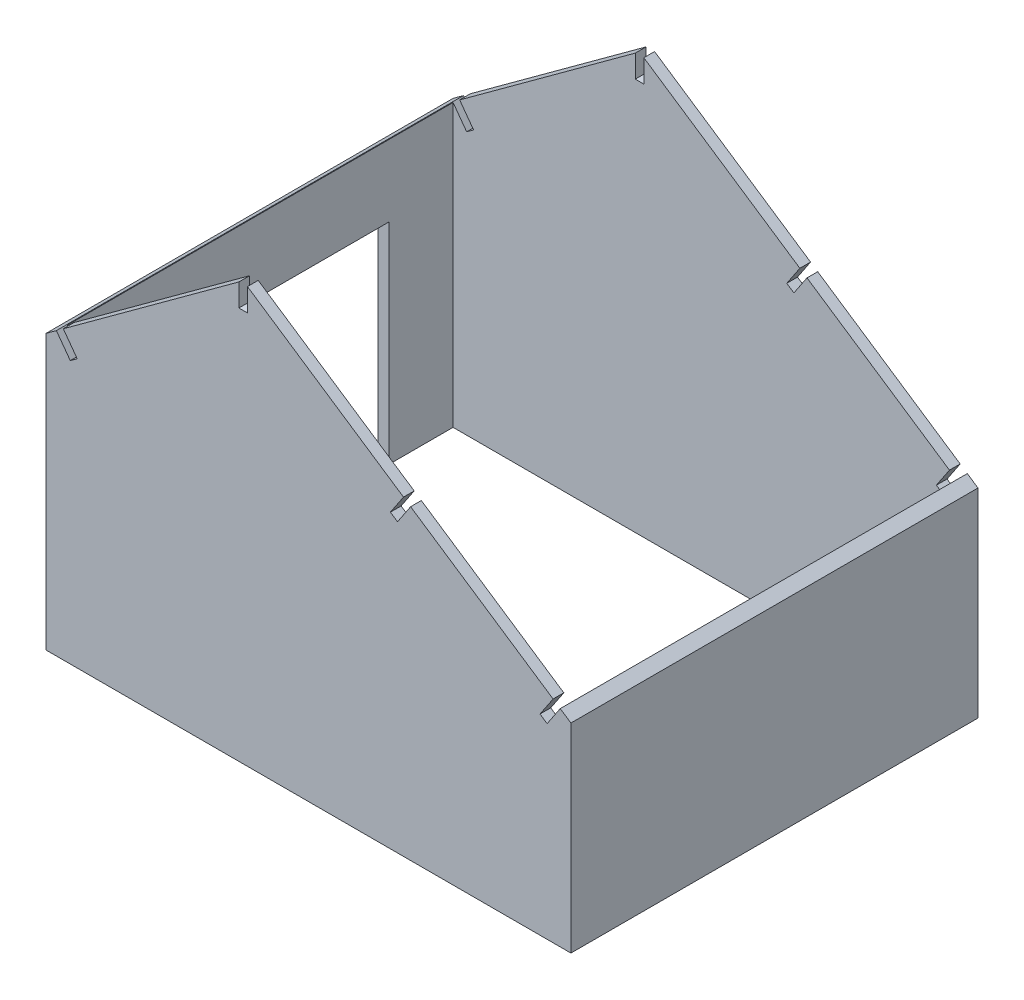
from build123d import *

# Parameters (mm, degrees)
EXTRUSION1_DEPTH        = 5
EXTRUSION3_DEPTH        = 180
EXTRUSION4_DEPTH        = 5
ESQUISSE4_W             = 120
ESQUISSE4_H             = 98
ENL_V_MAT_EXTRU_1_DEPTH = 5
ESQUISSE5_W             = 4
ESQUISSE5_H             = 208.681974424
ENL_V_MAT_EXTRU_2_DEPTH = 11
ESQUISSE6_W             = 4
ESQUISSE6_H             = 208.889064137
ENL_V_MAT_EXTRU_3_DEPTH = 11
ESQUISSE7_W             = 4
ESQUISSE7_H             = 202.199630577
ENL_V_MAT_EXTRU_5_DEPTH = 12


with BuildPart() as part:
    # Esquisse1 → Extrusion1 (new body)
    with BuildSketch(Plane.XY):
        Polygon((-92.03825919, 55.113817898), (-92.03825919, -72.886182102), (152.96174081, -72.886182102), (152.96174081, 20.113817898), (0, 122.381632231), align=None)
    extrude(amount=-EXTRUSION1_DEPTH)

    # Esquisse2 → Extrusion3 (add)
    with BuildSketch(Plane(origin=(0, 0, -5), x_dir=(-1, 0, 0), z_dir=(0, 0, -1))):
        Polygon((-152.96174081, 20.113817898), (-147.96174081, 23.456739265), (-147.96174081, -72.886182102), (-152.96174081, -72.886182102), align=None)
        Polygon((92.03825919, -72.886182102), (87.03825919, -72.886182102), (87.03825919, 58.768157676), (92.03825919, 55.113817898), align=None)
    extrude(amount=EXTRUSION3_DEPTH)

    # Esquisse3 → Extrusion4 (add)
    with BuildSketch(Plane(origin=(0, 0, -185), x_dir=(-1, 0, 0), z_dir=(0, 0, -1))):
        Polygon((0, 122.381632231), (87.03825919, 58.768157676), (92.03825919, 55.113817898), (92.03825919, -72.886182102), (87.03825919, -72.886182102), (-147.96174081, -72.886182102), (-152.96174081, -72.886182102), (-152.96174081, 20.113817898), (-147.96174081, 23.456739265), align=None)
    extrude(amount=EXTRUSION4_DEPTH)

    # Esquisse4 → Enl_v. mat.-Extru.1 (cut)
    with BuildSketch(Plane.ZY.offset(92.03825919)):
        with Locations((-95, -23.886182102)):
            Rectangle(ESQUISSE4_W, ESQUISSE4_H)
    extrude(amount=-ENL_V_MAT_EXTRU_1_DEPTH, mode=Mode.SUBTRACT)

    # Esquisse5 → Enl_v. mat.-Extru.2 (cut)
    with BuildSketch(Plane(origin=(-58.301838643, 79.770686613, 0), x_dir=(-0.807353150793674, -0.5900685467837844, 0), z_dir=(-0.5900685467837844, 0.807353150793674, 0))):
        with Locations((33.786448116, -99.347541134)):
            Rectangle(ESQUISSE5_W, ESQUISSE5_H)
    extrude(amount=-ENL_V_MAT_EXTRU_2_DEPTH, mode=Mode.SUBTRACT)

    # Esquisse6 → Enl_v. mat.-Extru.3 (cut)
    with BuildSketch(Plane(origin=(56.546064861, 84.575822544, 0), x_dir=(-0.8313138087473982, 0.5558033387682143, 0), z_dir=(0.5558033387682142, 0.8313138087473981, 0))):
        with Locations((-107.979880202, -98.582032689)):
            Rectangle(ESQUISSE6_W, ESQUISSE6_H)
        with Locations((-23.979880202, -98.582032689)):
            Rectangle(ESQUISSE6_W, ESQUISSE6_H)
    extrude(amount=-ENL_V_MAT_EXTRU_3_DEPTH, mode=Mode.SUBTRACT)

    # Esquisse7 → Enl_v. mat.-Extru.5 (cut)
    with BuildSketch(Plane.XZ.offset(-122.381632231)):
        with Locations((0, -93.693378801)):
            Rectangle(ESQUISSE7_W, ESQUISSE7_H)
    extrude(amount=ENL_V_MAT_EXTRU_5_DEPTH, mode=Mode.SUBTRACT)


solid = part.part
